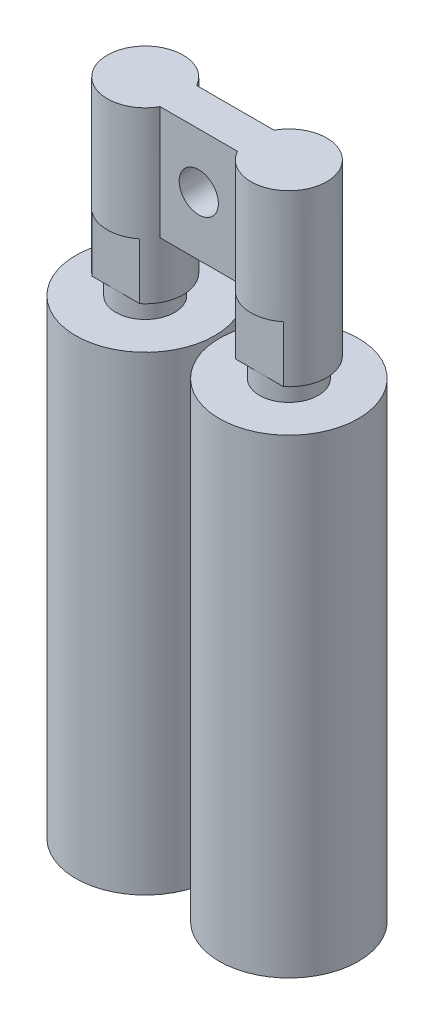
ISO-10303-21;
HEADER;
FILE_DESCRIPTION(('STEP AP214'),'2;1');
FILE_NAME('part.step','',(''),(''),'','','');
FILE_SCHEMA(('AUTOMOTIVE_DESIGN { 1 0 10303 214 1 1 1 1 }'));
ENDSEC;
DATA;
#1=APPLICATION_CONTEXT('core data for automotive mechanical design processes');
#2=APPLICATION_PROTOCOL_DEFINITION('international standard','automotive_design',2000,#1);
#3=PRODUCT_CONTEXT('',#1,'mechanical');
#4=PRODUCT('Part','Part','',(#3));
#5=PRODUCT_RELATED_PRODUCT_CATEGORY('part','',(#4));
#6=PRODUCT_DEFINITION_FORMATION('','',#4);
#7=PRODUCT_DEFINITION_CONTEXT('part definition',#1,'design');
#8=PRODUCT_DEFINITION('design','',#6,#7);
#9=PRODUCT_DEFINITION_SHAPE('','',#8);
#10=(LENGTH_UNIT() NAMED_UNIT(*) SI_UNIT(.MILLI.,.METRE.));
#11=(NAMED_UNIT(*) PLANE_ANGLE_UNIT() SI_UNIT($,.RADIAN.));
#12=(NAMED_UNIT(*) SI_UNIT($,.STERADIAN.) SOLID_ANGLE_UNIT());
#13=UNCERTAINTY_MEASURE_WITH_UNIT(LENGTH_MEASURE(1.E-05),#10,'distance_accuracy_value','');
#14=(GEOMETRIC_REPRESENTATION_CONTEXT(3) GLOBAL_UNCERTAINTY_ASSIGNED_CONTEXT((#13)) GLOBAL_UNIT_ASSIGNED_CONTEXT((#10,
#11,#12)) REPRESENTATION_CONTEXT('',''));
#15=CARTESIAN_POINT('',(0.,0.,0.));
#16=DIRECTION('',(0.,0.,1.));
#17=DIRECTION('',(1.,0.,0.));
#18=AXIS2_PLACEMENT_3D('',#15,#16,#17);
#19=CARTESIAN_POINT('',(-55.,-88.,0.));
#20=DIRECTION('',(0.,1.,0.));
#21=DIRECTION('',(-1.,0.,0.));
#22=AXIS2_PLACEMENT_3D('',#19,#20,#21);
#23=CYLINDRICAL_SURFACE('',#22,29.);
#24=DIRECTION('',(0.,1.,0.));
#25=VECTOR('',#24,1.);
#26=CARTESIAN_POINT('',(-29.6031498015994,-88.,13.9999999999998));
#27=LINE('',#26,#25);
#28=CARTESIAN_POINT('',(-29.6031498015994,42.,13.9999999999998));
#29=VERTEX_POINT('',#28);
#30=CARTESIAN_POINT('',(-29.6031498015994,-45.,13.9999999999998));
#31=VERTEX_POINT('',#30);
#32=EDGE_CURVE('E171',#29,#31,#27,.F.);
#33=ORIENTED_EDGE('',*,*,#32,.F.);
#34=CARTESIAN_POINT('',(-55.,42.,0.));
#35=DIRECTION('',(0.,1.,0.));
#36=DIRECTION('',(-1.,0.,0.));
#37=AXIS2_PLACEMENT_3D('',#34,#35,#36);
#38=CIRCLE('',#37,29.);
#39=CARTESIAN_POINT('',(-29.6031498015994,42.,-14.0000000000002));
#40=VERTEX_POINT('',#39);
#41=EDGE_CURVE('E162',#40,#29,#38,.T.);
#42=ORIENTED_EDGE('',*,*,#41,.F.);
#43=DIRECTION('',(0.,1.,0.));
#44=VECTOR('',#43,1.);
#45=CARTESIAN_POINT('',(-29.6031498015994,-88.,-14.0000000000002));
#46=LINE('',#45,#44);
#47=CARTESIAN_POINT('',(-29.6031498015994,-45.,-14.0000000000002));
#48=VERTEX_POINT('',#47);
#49=EDGE_CURVE('E183',#40,#48,#46,.F.);
#50=ORIENTED_EDGE('',*,*,#49,.T.);
#51=CARTESIAN_POINT('',(-55.,-45.,0.));
#52=DIRECTION('',(0.,-1.,0.));
#53=DIRECTION('',(1.,0.,0.));
#54=AXIS2_PLACEMENT_3D('',#51,#52,#53);
#55=CIRCLE('',#54,29.);
#56=EDGE_CURVE('E168',#48,#31,#55,.T.);
#57=ORIENTED_EDGE('',*,*,#56,.T.);
#58=EDGE_LOOP('',(#33,#42,#50,#57));
#59=FACE_BOUND('',#58,.T.);
#60=CARTESIAN_POINT('',(-55.,-45.,0.));
#61=DIRECTION('',(0.,-1.,0.));
#62=DIRECTION('',(1.,0.,0.));
#63=AXIS2_PLACEMENT_3D('',#60,#61,#62);
#64=CIRCLE('',#63,29.);
#65=CARTESIAN_POINT('',(-73.296174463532,-45.,22.5));
#66=VERTEX_POINT('',#65);
#67=CARTESIAN_POINT('',(-36.703825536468,-45.,22.5));
#68=VERTEX_POINT('',#67);
#69=EDGE_CURVE('E138',#66,#68,#64,.F.);
#70=ORIENTED_EDGE('',*,*,#69,.T.);
#71=DIRECTION('',(0.,1.,0.));
#72=VECTOR('',#71,1.);
#73=CARTESIAN_POINT('',(-36.703825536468,-88.,22.5));
#74=LINE('',#73,#72);
#75=CARTESIAN_POINT('',(-36.703825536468,-88.,22.5));
#76=VERTEX_POINT('',#75);
#77=EDGE_CURVE('E301',#68,#76,#74,.F.);
#78=ORIENTED_EDGE('',*,*,#77,.T.);
#79=CARTESIAN_POINT('',(-55.,-88.,0.));
#80=DIRECTION('',(0.,1.,0.));
#81=DIRECTION('',(-1.,0.,0.));
#82=AXIS2_PLACEMENT_3D('',#79,#80,#81);
#83=CIRCLE('',#82,29.);
#84=CARTESIAN_POINT('',(-36.703825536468,-88.,-22.5));
#85=VERTEX_POINT('',#84);
#86=EDGE_CURVE('E167',#76,#85,#83,.T.);
#87=ORIENTED_EDGE('',*,*,#86,.T.);
#88=DIRECTION('',(0.,1.,0.));
#89=VECTOR('',#88,1.);
#90=CARTESIAN_POINT('',(-36.703825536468,-88.,-22.5));
#91=LINE('',#90,#89);
#92=CARTESIAN_POINT('',(-36.703825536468,-45.,-22.5));
#93=VERTEX_POINT('',#92);
#94=EDGE_CURVE('E136',#85,#93,#91,.T.);
#95=ORIENTED_EDGE('',*,*,#94,.T.);
#96=CARTESIAN_POINT('',(-73.296174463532,-45.,-22.5));
#97=VERTEX_POINT('',#96);
#98=EDGE_CURVE('E130',#93,#97,#64,.F.);
#99=ORIENTED_EDGE('',*,*,#98,.T.);
#100=DIRECTION('',(0.,1.,0.));
#101=VECTOR('',#100,1.);
#102=CARTESIAN_POINT('',(-73.296174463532,-88.,-22.5));
#103=LINE('',#102,#101);
#104=CARTESIAN_POINT('',(-73.296174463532,-88.,-22.5));
#105=VERTEX_POINT('',#104);
#106=EDGE_CURVE('E116',#97,#105,#103,.F.);
#107=ORIENTED_EDGE('',*,*,#106,.T.);
#108=CARTESIAN_POINT('',(-73.296174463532,-88.,22.5));
#109=VERTEX_POINT('',#108);
#110=EDGE_CURVE('E165',#105,#109,#83,.T.);
#111=ORIENTED_EDGE('',*,*,#110,.T.);
#112=DIRECTION('',(0.,1.,0.));
#113=VECTOR('',#112,1.);
#114=CARTESIAN_POINT('',(-73.296174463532,-88.,22.5));
#115=LINE('',#114,#113);
#116=EDGE_CURVE('E142',#109,#66,#115,.T.);
#117=ORIENTED_EDGE('',*,*,#116,.T.);
#118=EDGE_LOOP('',(#70,#78,#87,#95,#99,#107,#111,#117));
#119=FACE_BOUND('',#118,.T.);
#120=ADVANCED_FACE('F16',(#59,#119),#23,.T.);
#121=CARTESIAN_POINT('',(-55.,-88.,0.));
#122=DIRECTION('',(0.,1.,0.));
#123=DIRECTION('',(-1.,0.,0.));
#124=AXIS2_PLACEMENT_3D('',#121,#122,#123);
#125=PLANE('',#124);
#126=DIRECTION('',(1.,0.,0.));
#127=VECTOR('',#126,1.);
#128=CARTESIAN_POINT('',(-55.,-88.,22.5));
#129=LINE('',#128,#127);
#130=CARTESIAN_POINT('',(-55.,-88.,22.5));
#131=VERTEX_POINT('',#130);
#132=EDGE_CURVE('E39',#109,#131,#129,.T.);
#133=ORIENTED_EDGE('',*,*,#132,.F.);
#134=ORIENTED_EDGE('',*,*,#110,.F.);
#135=DIRECTION('',(-1.,0.,0.));
#136=VECTOR('',#135,1.);
#137=CARTESIAN_POINT('',(-55.,-88.,-22.5));
#138=LINE('',#137,#136);
#139=CARTESIAN_POINT('',(-55.,-88.,-22.5));
#140=VERTEX_POINT('',#139);
#141=EDGE_CURVE('E121',#140,#105,#138,.T.);
#142=ORIENTED_EDGE('',*,*,#141,.F.);
#143=CARTESIAN_POINT('',(-55.,-88.,0.));
#144=DIRECTION('',(0.,1.,0.));
#145=DIRECTION('',(-1.,0.,0.));
#146=AXIS2_PLACEMENT_3D('',#143,#144,#145);
#147=CIRCLE('',#146,22.5);
#148=EDGE_CURVE('E191',#140,#131,#147,.T.);
#149=ORIENTED_EDGE('',*,*,#148,.T.);
#150=EDGE_LOOP('',(#133,#134,#142,#149));
#151=FACE_BOUND('',#150,.T.);
#152=ADVANCED_FACE('F229',(#151),#125,.F.);
#153=EDGE_CURVE('E299',#131,#76,#129,.T.);
#154=ORIENTED_EDGE('',*,*,#153,.F.);
#155=EDGE_CURVE('E153',#131,#140,#147,.T.);
#156=ORIENTED_EDGE('',*,*,#155,.T.);
#157=EDGE_CURVE('E31',#85,#140,#138,.T.);
#158=ORIENTED_EDGE('',*,*,#157,.F.);
#159=ORIENTED_EDGE('',*,*,#86,.F.);
#160=EDGE_LOOP('',(#154,#156,#158,#159));
#161=FACE_BOUND('',#160,.T.);
#162=ADVANCED_FACE('F236',(#161),#125,.F.);
#163=CARTESIAN_POINT('',(55.,-88.,-1.66533453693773E-13));
#164=DIRECTION('',(0.,1.,0.));
#165=DIRECTION('',(-1.,0.,0.));
#166=AXIS2_PLACEMENT_3D('',#163,#164,#165);
#167=CYLINDRICAL_SURFACE('',#166,29.);
#168=DIRECTION('',(0.,1.,0.));
#169=VECTOR('',#168,1.);
#170=CARTESIAN_POINT('',(29.6031498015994,-88.,14.));
#171=LINE('',#170,#169);
#172=CARTESIAN_POINT('',(29.6031498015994,-45.,14.));
#173=VERTEX_POINT('',#172);
#174=CARTESIAN_POINT('',(29.6031498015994,42.,14.));
#175=VERTEX_POINT('',#174);
#176=EDGE_CURVE('E160',#173,#175,#171,.T.);
#177=ORIENTED_EDGE('',*,*,#176,.F.);
#178=CARTESIAN_POINT('',(55.,-45.,-1.66533453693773E-13));
#179=DIRECTION('',(0.,-1.,0.));
#180=DIRECTION('',(1.,0.,0.));
#181=AXIS2_PLACEMENT_3D('',#178,#179,#180);
#182=CIRCLE('',#181,29.);
#183=CARTESIAN_POINT('',(29.6031498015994,-45.,-14.));
#184=VERTEX_POINT('',#183);
#185=EDGE_CURVE('E157',#173,#184,#182,.T.);
#186=ORIENTED_EDGE('',*,*,#185,.T.);
#187=DIRECTION('',(0.,1.,0.));
#188=VECTOR('',#187,1.);
#189=CARTESIAN_POINT('',(29.6031498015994,-88.,-14.));
#190=LINE('',#189,#188);
#191=CARTESIAN_POINT('',(29.6031498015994,42.,-14.));
#192=VERTEX_POINT('',#191);
#193=EDGE_CURVE('E186',#184,#192,#190,.T.);
#194=ORIENTED_EDGE('',*,*,#193,.T.);
#195=CARTESIAN_POINT('',(55.,42.,-1.66533453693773E-13));
#196=DIRECTION('',(0.,1.,0.));
#197=DIRECTION('',(-1.,0.,0.));
#198=AXIS2_PLACEMENT_3D('',#195,#196,#197);
#199=CIRCLE('',#198,29.);
#200=EDGE_CURVE('E149',#175,#192,#199,.T.);
#201=ORIENTED_EDGE('',*,*,#200,.F.);
#202=EDGE_LOOP('',(#177,#186,#194,#201));
#203=FACE_BOUND('',#202,.T.);
#204=CARTESIAN_POINT('',(55.,-45.,-1.66533453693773E-13));
#205=DIRECTION('',(0.,-1.,0.));
#206=DIRECTION('',(1.,0.,0.));
#207=AXIS2_PLACEMENT_3D('',#204,#205,#206);
#208=CIRCLE('',#207,29.);
#209=CARTESIAN_POINT('',(36.7038255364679,-45.,22.5));
#210=VERTEX_POINT('',#209);
#211=CARTESIAN_POINT('',(73.296174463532,-45.,22.5));
#212=VERTEX_POINT('',#211);
#213=EDGE_CURVE('E11',#210,#212,#208,.F.);
#214=ORIENTED_EDGE('',*,*,#213,.T.);
#215=DIRECTION('',(0.,1.,0.));
#216=VECTOR('',#215,1.);
#217=CARTESIAN_POINT('',(73.296174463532,-88.,22.5));
#218=LINE('',#217,#216);
#219=CARTESIAN_POINT('',(73.296174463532,-88.,22.5));
#220=VERTEX_POINT('',#219);
#221=EDGE_CURVE('E273',#212,#220,#218,.F.);
#222=ORIENTED_EDGE('',*,*,#221,.T.);
#223=CARTESIAN_POINT('',(55.,-88.,-1.66533453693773E-13));
#224=DIRECTION('',(0.,1.,0.));
#225=DIRECTION('',(-1.,0.,0.));
#226=AXIS2_PLACEMENT_3D('',#223,#224,#225);
#227=CIRCLE('',#226,29.);
#228=CARTESIAN_POINT('',(73.296174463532,-88.,-22.5));
#229=VERTEX_POINT('',#228);
#230=EDGE_CURVE('E156',#220,#229,#227,.T.);
#231=ORIENTED_EDGE('',*,*,#230,.T.);
#232=DIRECTION('',(0.,1.,0.));
#233=VECTOR('',#232,1.);
#234=CARTESIAN_POINT('',(73.296174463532,-88.,-22.5));
#235=LINE('',#234,#233);
#236=CARTESIAN_POINT('',(73.2961744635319,-45.,-22.5));
#237=VERTEX_POINT('',#236);
#238=EDGE_CURVE('E292',#229,#237,#235,.T.);
#239=ORIENTED_EDGE('',*,*,#238,.T.);
#240=CARTESIAN_POINT('',(36.7038255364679,-45.,-22.5));
#241=VERTEX_POINT('',#240);
#242=EDGE_CURVE('E20',#237,#241,#208,.F.);
#243=ORIENTED_EDGE('',*,*,#242,.T.);
#244=DIRECTION('',(0.,1.,0.));
#245=VECTOR('',#244,1.);
#246=CARTESIAN_POINT('',(36.703825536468,-88.,-22.5));
#247=LINE('',#246,#245);
#248=CARTESIAN_POINT('',(36.703825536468,-88.,-22.5));
#249=VERTEX_POINT('',#248);
#250=EDGE_CURVE('E284',#241,#249,#247,.F.);
#251=ORIENTED_EDGE('',*,*,#250,.T.);
#252=CARTESIAN_POINT('',(36.703825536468,-88.,22.5));
#253=VERTEX_POINT('',#252);
#254=EDGE_CURVE('E152',#249,#253,#227,.T.);
#255=ORIENTED_EDGE('',*,*,#254,.T.);
#256=DIRECTION('',(0.,1.,0.));
#257=VECTOR('',#256,1.);
#258=CARTESIAN_POINT('',(36.703825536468,-88.,22.5));
#259=LINE('',#258,#257);
#260=EDGE_CURVE('E275',#253,#210,#259,.T.);
#261=ORIENTED_EDGE('',*,*,#260,.T.);
#262=EDGE_LOOP('',(#214,#222,#231,#239,#243,#251,#255,#261));
#263=FACE_BOUND('',#262,.T.);
#264=ADVANCED_FACE('F262',(#203,#263),#167,.T.);
#265=CARTESIAN_POINT('',(55.,-88.,-1.66533453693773E-13));
#266=DIRECTION('',(0.,1.,0.));
#267=DIRECTION('',(-1.,0.,0.));
#268=AXIS2_PLACEMENT_3D('',#265,#266,#267);
#269=PLANE('',#268);
#270=DIRECTION('',(1.,0.,0.));
#271=VECTOR('',#270,1.);
#272=CARTESIAN_POINT('',(55.,-88.,22.5));
#273=LINE('',#272,#271);
#274=CARTESIAN_POINT('',(55.,-88.,22.5));
#275=VERTEX_POINT('',#274);
#276=EDGE_CURVE('E206',#253,#275,#273,.T.);
#277=ORIENTED_EDGE('',*,*,#276,.F.);
#278=ORIENTED_EDGE('',*,*,#254,.F.);
#279=DIRECTION('',(-1.,0.,0.));
#280=VECTOR('',#279,1.);
#281=CARTESIAN_POINT('',(55.,-88.,-22.5));
#282=LINE('',#281,#280);
#283=CARTESIAN_POINT('',(55.,-88.,-22.5));
#284=VERTEX_POINT('',#283);
#285=EDGE_CURVE('E207',#284,#249,#282,.T.);
#286=ORIENTED_EDGE('',*,*,#285,.F.);
#287=CARTESIAN_POINT('',(55.,-88.,-1.66533453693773E-13));
#288=DIRECTION('',(0.,1.,0.));
#289=DIRECTION('',(-1.,0.,0.));
#290=AXIS2_PLACEMENT_3D('',#287,#288,#289);
#291=CIRCLE('',#290,22.5);
#292=EDGE_CURVE('E148',#284,#275,#291,.T.);
#293=ORIENTED_EDGE('',*,*,#292,.T.);
#294=EDGE_LOOP('',(#277,#278,#286,#293));
#295=FACE_BOUND('',#294,.T.);
#296=ADVANCED_FACE('F204',(#295),#269,.F.);
#297=EDGE_CURVE('E296',#275,#220,#273,.T.);
#298=ORIENTED_EDGE('',*,*,#297,.F.);
#299=EDGE_CURVE('E192',#275,#284,#291,.T.);
#300=ORIENTED_EDGE('',*,*,#299,.T.);
#301=EDGE_CURVE('E126',#229,#284,#282,.T.);
#302=ORIENTED_EDGE('',*,*,#301,.F.);
#303=ORIENTED_EDGE('',*,*,#230,.F.);
#304=EDGE_LOOP('',(#298,#300,#302,#303));
#305=FACE_BOUND('',#304,.T.);
#306=ADVANCED_FACE('F255',(#305),#269,.F.);
#307=CARTESIAN_POINT('',(55.,-45.,13.9999999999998));
#308=DIRECTION('',(0.,-1.,0.));
#309=DIRECTION('',(1.,0.,0.));
#310=AXIS2_PLACEMENT_3D('',#307,#308,#309);
#311=PLANE('',#310);
#312=ORIENTED_EDGE('',*,*,#185,.F.);
#313=DIRECTION('',(-1.,0.,0.));
#314=VECTOR('',#313,1.);
#315=CARTESIAN_POINT('',(55.,-45.,13.9999999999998));
#316=LINE('',#315,#314);
#317=EDGE_CURVE('E178',#173,#31,#316,.T.);
#318=ORIENTED_EDGE('',*,*,#317,.T.);
#319=ORIENTED_EDGE('',*,*,#56,.F.);
#320=DIRECTION('',(-1.,0.,0.));
#321=VECTOR('',#320,1.);
#322=CARTESIAN_POINT('',(55.,-45.,-14.0000000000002));
#323=LINE('',#322,#321);
#324=EDGE_CURVE('E174',#184,#48,#323,.T.);
#325=ORIENTED_EDGE('',*,*,#324,.F.);
#326=EDGE_LOOP('',(#312,#318,#319,#325));
#327=FACE_BOUND('',#326,.T.);
#328=ADVANCED_FACE('F18',(#327),#311,.T.);
#329=CARTESIAN_POINT('',(-55.,42.,14.));
#330=DIRECTION('',(0.,1.,0.));
#331=DIRECTION('',(-1.,0.,0.));
#332=AXIS2_PLACEMENT_3D('',#329,#330,#331);
#333=PLANE('',#332);
#334=DIRECTION('',(1.,0.,0.));
#335=VECTOR('',#334,1.);
#336=CARTESIAN_POINT('',(-55.,42.,14.));
#337=LINE('',#336,#335);
#338=EDGE_CURVE('E180',#29,#175,#337,.T.);
#339=ORIENTED_EDGE('',*,*,#338,.T.);
#340=ORIENTED_EDGE('',*,*,#200,.T.);
#341=DIRECTION('',(1.,0.,0.));
#342=VECTOR('',#341,1.);
#343=CARTESIAN_POINT('',(-55.,42.,-14.));
#344=LINE('',#343,#342);
#345=EDGE_CURVE('E176',#40,#192,#344,.T.);
#346=ORIENTED_EDGE('',*,*,#345,.F.);
#347=ORIENTED_EDGE('',*,*,#41,.T.);
#348=EDGE_LOOP('',(#339,#340,#346,#347));
#349=FACE_BOUND('',#348,.T.);
#350=ADVANCED_FACE('F247',(#349),#333,.T.);
#351=CARTESIAN_POINT('',(-55.,-45.,14.));
#352=DIRECTION('',(0.,0.,-1.));
#353=DIRECTION('',(-1.,0.,0.));
#354=AXIS2_PLACEMENT_3D('',#351,#352,#353);
#355=PLANE('',#354);
#356=CARTESIAN_POINT('',(0.,0.,14.));
#357=DIRECTION('',(0.,0.,-1.));
#358=DIRECTION('',(-1.,0.,0.));
#359=AXIS2_PLACEMENT_3D('',#356,#357,#358);
#360=CIRCLE('',#359,15.);
#361=CARTESIAN_POINT('',(-15.,0.,14.));
#362=VERTEX_POINT('',#361);
#363=EDGE_CURVE('E141',#362,#362,#360,.T.);
#364=ORIENTED_EDGE('',*,*,#363,.T.);
#365=EDGE_LOOP('',(#364));
#366=FACE_BOUND('',#365,.T.);
#367=ORIENTED_EDGE('',*,*,#317,.F.);
#368=ORIENTED_EDGE('',*,*,#176,.T.);
#369=ORIENTED_EDGE('',*,*,#338,.F.);
#370=ORIENTED_EDGE('',*,*,#32,.T.);
#371=EDGE_LOOP('',(#367,#368,#369,#370));
#372=FACE_BOUND('',#371,.T.);
#373=ADVANCED_FACE('F244',(#366,#372),#355,.F.);
#374=CARTESIAN_POINT('',(-55.,-45.,-14.));
#375=DIRECTION('',(0.,0.,-1.));
#376=DIRECTION('',(-1.,0.,0.));
#377=AXIS2_PLACEMENT_3D('',#374,#375,#376);
#378=PLANE('',#377);
#379=CARTESIAN_POINT('',(0.,0.,-14.));
#380=DIRECTION('',(0.,0.,-1.));
#381=DIRECTION('',(-1.,0.,0.));
#382=AXIS2_PLACEMENT_3D('',#379,#380,#381);
#383=CIRCLE('',#382,15.);
#384=CARTESIAN_POINT('',(-15.,0.,-14.));
#385=VERTEX_POINT('',#384);
#386=EDGE_CURVE('E137',#385,#385,#383,.T.);
#387=ORIENTED_EDGE('',*,*,#386,.F.);
#388=EDGE_LOOP('',(#387));
#389=FACE_BOUND('',#388,.T.);
#390=ORIENTED_EDGE('',*,*,#193,.F.);
#391=ORIENTED_EDGE('',*,*,#324,.T.);
#392=ORIENTED_EDGE('',*,*,#49,.F.);
#393=ORIENTED_EDGE('',*,*,#345,.T.);
#394=EDGE_LOOP('',(#390,#391,#392,#393));
#395=FACE_BOUND('',#394,.T.);
#396=ADVANCED_FACE('F224',(#389,#395),#378,.T.);
#397=CARTESIAN_POINT('',(-55.,-103.,0.));
#398=DIRECTION('',(0.,1.,0.));
#399=DIRECTION('',(-1.,0.,0.));
#400=AXIS2_PLACEMENT_3D('',#397,#398,#399);
#401=CYLINDRICAL_SURFACE('',#400,22.5);
#402=CARTESIAN_POINT('',(-55.,-103.,0.));
#403=DIRECTION('',(0.,-1.,0.));
#404=DIRECTION('',(1.,0.,0.));
#405=AXIS2_PLACEMENT_3D('',#402,#403,#404);
#406=CIRCLE('',#405,22.5);
#407=CARTESIAN_POINT('',(-32.5,-103.,0.));
#408=VERTEX_POINT('',#407);
#409=EDGE_CURVE('E308',#408,#408,#406,.F.);
#410=ORIENTED_EDGE('',*,*,#409,.T.);
#411=EDGE_LOOP('',(#410));
#412=FACE_BOUND('',#411,.T.);
#413=ORIENTED_EDGE('',*,*,#155,.F.);
#414=ORIENTED_EDGE('',*,*,#148,.F.);
#415=EDGE_LOOP('',(#413,#414));
#416=FACE_BOUND('',#415,.T.);
#417=ADVANCED_FACE('F212',(#412,#416),#401,.T.);
#418=CARTESIAN_POINT('',(55.,-103.,-1.66533453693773E-13));
#419=DIRECTION('',(0.,1.,0.));
#420=DIRECTION('',(-1.,0.,0.));
#421=AXIS2_PLACEMENT_3D('',#418,#419,#420);
#422=CYLINDRICAL_SURFACE('',#421,22.5);
#423=CARTESIAN_POINT('',(55.,-103.,-1.66533453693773E-13));
#424=DIRECTION('',(0.,-1.,0.));
#425=DIRECTION('',(1.,0.,0.));
#426=AXIS2_PLACEMENT_3D('',#423,#424,#425);
#427=CIRCLE('',#426,22.5);
#428=CARTESIAN_POINT('',(77.5,-103.,-1.66533453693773E-13));
#429=VERTEX_POINT('',#428);
#430=EDGE_CURVE('E318',#429,#429,#427,.F.);
#431=ORIENTED_EDGE('',*,*,#430,.T.);
#432=EDGE_LOOP('',(#431));
#433=FACE_BOUND('',#432,.T.);
#434=ORIENTED_EDGE('',*,*,#299,.F.);
#435=ORIENTED_EDGE('',*,*,#292,.F.);
#436=EDGE_LOOP('',(#434,#435));
#437=FACE_BOUND('',#436,.T.);
#438=ADVANCED_FACE('F209',(#433,#437),#422,.T.);
#439=CARTESIAN_POINT('',(0.,0.,-29.));
#440=DIRECTION('',(0.,0.,1.));
#441=DIRECTION('',(1.,0.,0.));
#442=AXIS2_PLACEMENT_3D('',#439,#440,#441);
#443=CYLINDRICAL_SURFACE('',#442,15.);
#444=ORIENTED_EDGE('',*,*,#386,.T.);
#445=EDGE_LOOP('',(#444));
#446=FACE_BOUND('',#445,.T.);
#447=ORIENTED_EDGE('',*,*,#363,.F.);
#448=EDGE_LOOP('',(#447));
#449=FACE_BOUND('',#448,.T.);
#450=ADVANCED_FACE('F211',(#446,#449),#443,.F.);
#451=CARTESIAN_POINT('',(-90.,-45.,-22.5));
#452=DIRECTION('',(0.,0.,-1.));
#453=DIRECTION('',(-1.,0.,0.));
#454=AXIS2_PLACEMENT_3D('',#451,#452,#453);
#455=PLANE('',#454);
#456=ORIENTED_EDGE('',*,*,#301,.T.);
#457=ORIENTED_EDGE('',*,*,#285,.T.);
#458=ORIENTED_EDGE('',*,*,#250,.F.);
#459=DIRECTION('',(1.,0.,0.));
#460=VECTOR('',#459,1.);
#461=CARTESIAN_POINT('',(-90.,-45.,-22.5));
#462=LINE('',#461,#460);
#463=EDGE_CURVE('E132',#241,#237,#462,.T.);
#464=ORIENTED_EDGE('',*,*,#463,.T.);
#465=ORIENTED_EDGE('',*,*,#238,.F.);
#466=EDGE_LOOP('',(#456,#457,#458,#464,#465));
#467=FACE_BOUND('',#466,.T.);
#468=ADVANCED_FACE('F221',(#467),#455,.T.);
#469=CARTESIAN_POINT('',(0.699999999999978,-45.,0.));
#470=DIRECTION('',(0.,-1.,0.));
#471=DIRECTION('',(1.,0.,0.));
#472=AXIS2_PLACEMENT_3D('',#469,#470,#471);
#473=PLANE('',#472);
#474=ORIENTED_EDGE('',*,*,#463,.F.);
#475=ORIENTED_EDGE('',*,*,#242,.F.);
#476=EDGE_LOOP('',(#474,#475));
#477=FACE_BOUND('',#476,.T.);
#478=ADVANCED_FACE('F363',(#477),#473,.T.);
#479=CARTESIAN_POINT('',(-90.,-45.,22.5));
#480=DIRECTION('',(0.,0.,1.));
#481=DIRECTION('',(1.,0.,0.));
#482=AXIS2_PLACEMENT_3D('',#479,#480,#481);
#483=PLANE('',#482);
#484=ORIENTED_EDGE('',*,*,#276,.T.);
#485=ORIENTED_EDGE('',*,*,#297,.T.);
#486=ORIENTED_EDGE('',*,*,#221,.F.);
#487=DIRECTION('',(-1.,0.,0.));
#488=VECTOR('',#487,1.);
#489=CARTESIAN_POINT('',(-90.,-45.,22.5));
#490=LINE('',#489,#488);
#491=EDGE_CURVE('E280',#212,#210,#490,.T.);
#492=ORIENTED_EDGE('',*,*,#491,.T.);
#493=ORIENTED_EDGE('',*,*,#260,.F.);
#494=EDGE_LOOP('',(#484,#485,#486,#492,#493));
#495=FACE_BOUND('',#494,.T.);
#496=ADVANCED_FACE('F282',(#495),#483,.T.);
#497=ORIENTED_EDGE('',*,*,#491,.F.);
#498=ORIENTED_EDGE('',*,*,#213,.F.);
#499=EDGE_LOOP('',(#497,#498));
#500=FACE_BOUND('',#499,.T.);
#501=ADVANCED_FACE('F279',(#500),#473,.T.);
#502=ORIENTED_EDGE('',*,*,#157,.T.);
#503=ORIENTED_EDGE('',*,*,#141,.T.);
#504=ORIENTED_EDGE('',*,*,#106,.F.);
#505=EDGE_CURVE('E119',#97,#93,#462,.T.);
#506=ORIENTED_EDGE('',*,*,#505,.T.);
#507=ORIENTED_EDGE('',*,*,#94,.F.);
#508=EDGE_LOOP('',(#502,#503,#504,#506,#507));
#509=FACE_BOUND('',#508,.T.);
#510=ADVANCED_FACE('F118',(#509),#455,.T.);
#511=ORIENTED_EDGE('',*,*,#505,.F.);
#512=ORIENTED_EDGE('',*,*,#98,.F.);
#513=EDGE_LOOP('',(#511,#512));
#514=FACE_BOUND('',#513,.T.);
#515=ADVANCED_FACE('F129',(#514),#473,.T.);
#516=EDGE_CURVE('E131',#68,#66,#490,.T.);
#517=ORIENTED_EDGE('',*,*,#516,.F.);
#518=ORIENTED_EDGE('',*,*,#69,.F.);
#519=EDGE_LOOP('',(#517,#518));
#520=FACE_BOUND('',#519,.T.);
#521=ADVANCED_FACE('F360',(#520),#473,.T.);
#522=ORIENTED_EDGE('',*,*,#132,.T.);
#523=ORIENTED_EDGE('',*,*,#153,.T.);
#524=ORIENTED_EDGE('',*,*,#77,.F.);
#525=ORIENTED_EDGE('',*,*,#516,.T.);
#526=ORIENTED_EDGE('',*,*,#116,.F.);
#527=EDGE_LOOP('',(#522,#523,#524,#525,#526));
#528=FACE_BOUND('',#527,.T.);
#529=ADVANCED_FACE('F356',(#528),#483,.T.);
#530=CARTESIAN_POINT('',(-55.,-463.,0.));
#531=DIRECTION('',(0.,1.,0.));
#532=DIRECTION('',(-1.,0.,0.));
#533=AXIS2_PLACEMENT_3D('',#530,#531,#532);
#534=CYLINDRICAL_SURFACE('',#533,53.25);
#535=CARTESIAN_POINT('',(-55.,-463.,0.));
#536=DIRECTION('',(0.,-1.,0.));
#537=DIRECTION('',(1.,0.,0.));
#538=AXIS2_PLACEMENT_3D('',#535,#536,#537);
#539=CIRCLE('',#538,53.25);
#540=CARTESIAN_POINT('',(-1.75,-463.,0.));
#541=VERTEX_POINT('',#540);
#542=EDGE_CURVE('E310',#541,#541,#539,.T.);
#543=ORIENTED_EDGE('',*,*,#542,.F.);
#544=EDGE_LOOP('',(#543));
#545=FACE_BOUND('',#544,.T.);
#546=CARTESIAN_POINT('',(-55.,-103.,0.));
#547=DIRECTION('',(0.,-1.,0.));
#548=DIRECTION('',(1.,0.,0.));
#549=AXIS2_PLACEMENT_3D('',#546,#547,#548);
#550=CIRCLE('',#549,53.25);
#551=CARTESIAN_POINT('',(-1.75,-103.,0.));
#552=VERTEX_POINT('',#551);
#553=EDGE_CURVE('E313',#552,#552,#550,.T.);
#554=ORIENTED_EDGE('',*,*,#553,.T.);
#555=EDGE_LOOP('',(#554));
#556=FACE_BOUND('',#555,.T.);
#557=ADVANCED_FACE('F352',(#545,#556),#534,.T.);
#558=CARTESIAN_POINT('',(-55.,-463.,0.));
#559=DIRECTION('',(0.,-1.,0.));
#560=DIRECTION('',(1.,0.,0.));
#561=AXIS2_PLACEMENT_3D('',#558,#559,#560);
#562=PLANE('',#561);
#563=ORIENTED_EDGE('',*,*,#542,.T.);
#564=EDGE_LOOP('',(#563));
#565=FACE_BOUND('',#564,.T.);
#566=ADVANCED_FACE('F348',(#565),#562,.T.);
#567=CARTESIAN_POINT('',(-55.,-103.,0.));
#568=DIRECTION('',(0.,-1.,0.));
#569=DIRECTION('',(1.,0.,0.));
#570=AXIS2_PLACEMENT_3D('',#567,#568,#569);
#571=PLANE('',#570);
#572=ORIENTED_EDGE('',*,*,#409,.F.);
#573=EDGE_LOOP('',(#572));
#574=FACE_BOUND('',#573,.T.);
#575=ORIENTED_EDGE('',*,*,#553,.F.);
#576=EDGE_LOOP('',(#575));
#577=FACE_BOUND('',#576,.T.);
#578=ADVANCED_FACE('F344',(#574,#577),#571,.F.);
#579=CARTESIAN_POINT('',(55.,-463.,-1.66533453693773E-13));
#580=DIRECTION('',(0.,1.,0.));
#581=DIRECTION('',(-1.,0.,0.));
#582=AXIS2_PLACEMENT_3D('',#579,#580,#581);
#583=CYLINDRICAL_SURFACE('',#582,53.25);
#584=CARTESIAN_POINT('',(55.,-463.,-1.66533453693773E-13));
#585=DIRECTION('',(0.,-1.,0.));
#586=DIRECTION('',(1.,0.,0.));
#587=AXIS2_PLACEMENT_3D('',#584,#585,#586);
#588=CIRCLE('',#587,53.25);
#589=CARTESIAN_POINT('',(108.25,-463.,-1.66533453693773E-13));
#590=VERTEX_POINT('',#589);
#591=EDGE_CURVE('E320',#590,#590,#588,.T.);
#592=ORIENTED_EDGE('',*,*,#591,.F.);
#593=EDGE_LOOP('',(#592));
#594=FACE_BOUND('',#593,.T.);
#595=CARTESIAN_POINT('',(55.,-103.,-1.66533453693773E-13));
#596=DIRECTION('',(0.,-1.,0.));
#597=DIRECTION('',(1.,0.,0.));
#598=AXIS2_PLACEMENT_3D('',#595,#596,#597);
#599=CIRCLE('',#598,53.25);
#600=CARTESIAN_POINT('',(108.25,-103.,-1.66533453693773E-13));
#601=VERTEX_POINT('',#600);
#602=EDGE_CURVE('E323',#601,#601,#599,.T.);
#603=ORIENTED_EDGE('',*,*,#602,.T.);
#604=EDGE_LOOP('',(#603));
#605=FACE_BOUND('',#604,.T.);
#606=ADVANCED_FACE('F327',(#594,#605),#583,.T.);
#607=CARTESIAN_POINT('',(55.,-463.,-1.66533453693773E-13));
#608=DIRECTION('',(0.,-1.,0.));
#609=DIRECTION('',(1.,0.,0.));
#610=AXIS2_PLACEMENT_3D('',#607,#608,#609);
#611=PLANE('',#610);
#612=ORIENTED_EDGE('',*,*,#591,.T.);
#613=EDGE_LOOP('',(#612));
#614=FACE_BOUND('',#613,.T.);
#615=ADVANCED_FACE('F331',(#614),#611,.T.);
#616=CARTESIAN_POINT('',(55.,-103.,-1.66533453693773E-13));
#617=DIRECTION('',(0.,-1.,0.));
#618=DIRECTION('',(1.,0.,0.));
#619=AXIS2_PLACEMENT_3D('',#616,#617,#618);
#620=PLANE('',#619);
#621=ORIENTED_EDGE('',*,*,#430,.F.);
#622=EDGE_LOOP('',(#621));
#623=FACE_BOUND('',#622,.T.);
#624=ORIENTED_EDGE('',*,*,#602,.F.);
#625=EDGE_LOOP('',(#624));
#626=FACE_BOUND('',#625,.T.);
#627=ADVANCED_FACE('F329',(#623,#626),#620,.F.);
#628=CLOSED_SHELL('',(#120,#152,#162,#264,#296,#306,#328,#350,#373,#396,#417,#438,#450,#468,
#478,#496,#501,#510,#515,#521,#529,#557,#566,#578,#606,#615,#627));
#629=MANIFOLD_SOLID_BREP('B1',#628);
#630=ADVANCED_BREP_SHAPE_REPRESENTATION('',(#18,#629),#14);
#631=SHAPE_DEFINITION_REPRESENTATION(#9,#630);
ENDSEC;
END-ISO-10303-21;
